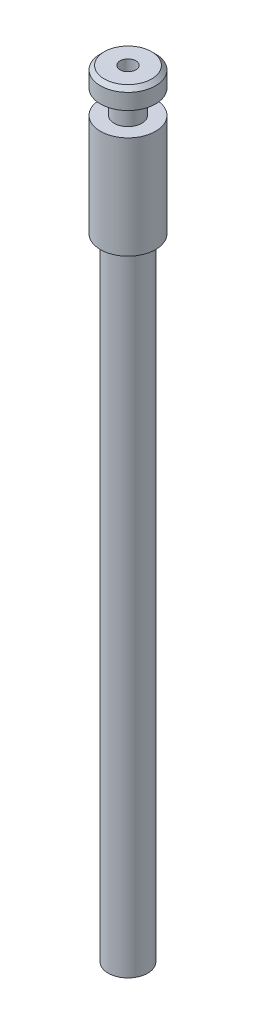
ISO-10303-21;
HEADER;
FILE_DESCRIPTION(('STEP AP214'),'2;1');
FILE_NAME('part.step','',(''),(''),'','','');
FILE_SCHEMA(('AUTOMOTIVE_DESIGN { 1 0 10303 214 1 1 1 1 }'));
ENDSEC;
DATA;
#1=APPLICATION_CONTEXT('core data for automotive mechanical design processes');
#2=APPLICATION_PROTOCOL_DEFINITION('international standard','automotive_design',2000,#1);
#3=PRODUCT_CONTEXT('',#1,'mechanical');
#4=PRODUCT('Part','Part','',(#3));
#5=PRODUCT_RELATED_PRODUCT_CATEGORY('part','',(#4));
#6=PRODUCT_DEFINITION_FORMATION('','',#4);
#7=PRODUCT_DEFINITION_CONTEXT('part definition',#1,'design');
#8=PRODUCT_DEFINITION('design','',#6,#7);
#9=PRODUCT_DEFINITION_SHAPE('','',#8);
#10=(LENGTH_UNIT() NAMED_UNIT(*) SI_UNIT(.MILLI.,.METRE.));
#11=(NAMED_UNIT(*) PLANE_ANGLE_UNIT() SI_UNIT($,.RADIAN.));
#12=(NAMED_UNIT(*) SI_UNIT($,.STERADIAN.) SOLID_ANGLE_UNIT());
#13=UNCERTAINTY_MEASURE_WITH_UNIT(LENGTH_MEASURE(1.E-05),#10,'distance_accuracy_value','');
#14=(GEOMETRIC_REPRESENTATION_CONTEXT(3) GLOBAL_UNCERTAINTY_ASSIGNED_CONTEXT((#13)) GLOBAL_UNIT_ASSIGNED_CONTEXT((#10,
#11,#12)) REPRESENTATION_CONTEXT('',''));
#15=CARTESIAN_POINT('',(0.,0.,0.));
#16=DIRECTION('',(0.,0.,1.));
#17=DIRECTION('',(1.,0.,0.));
#18=AXIS2_PLACEMENT_3D('',#15,#16,#17);
#19=CARTESIAN_POINT('',(0.,-16.,0.));
#20=DIRECTION('',(0.,-1.,0.));
#21=DIRECTION('',(0.,0.,-1.));
#22=AXIS2_PLACEMENT_3D('',#19,#20,#21);
#23=PLANE('',#22);
#24=CARTESIAN_POINT('',(0.,-16.,0.));
#25=DIRECTION('',(0.,-1.,0.));
#26=DIRECTION('',(0.,0.,-1.));
#27=AXIS2_PLACEMENT_3D('',#24,#25,#26);
#28=CIRCLE('',#27,3.5);
#29=CARTESIAN_POINT('',(0.,-16.,3.5));
#30=VERTEX_POINT('',#29);
#31=EDGE_CURVE('E53',#30,#30,#28,.T.);
#32=ORIENTED_EDGE('',*,*,#31,.T.);
#33=EDGE_LOOP('',(#32));
#34=FACE_BOUND('',#33,.T.);
#35=CARTESIAN_POINT('',(0.,-16.,0.));
#36=DIRECTION('',(0.,-1.,0.));
#37=DIRECTION('',(0.,0.,-1.));
#38=AXIS2_PLACEMENT_3D('',#35,#36,#37);
#39=CIRCLE('',#38,2.5);
#40=CARTESIAN_POINT('',(0.,-16.,-2.5));
#41=VERTEX_POINT('',#40);
#42=EDGE_CURVE('E60',#41,#41,#39,.T.);
#43=ORIENTED_EDGE('',*,*,#42,.F.);
#44=EDGE_LOOP('',(#43));
#45=FACE_BOUND('',#44,.T.);
#46=ADVANCED_FACE('F30',(#34,#45),#23,.T.);
#47=CARTESIAN_POINT('',(0.,0.,0.));
#48=DIRECTION('',(0.,1.,0.));
#49=DIRECTION('',(0.,0.,1.));
#50=AXIS2_PLACEMENT_3D('',#47,#48,#49);
#51=PLANE('',#50);
#52=CARTESIAN_POINT('',(0.,0.,0.));
#53=DIRECTION('',(0.,1.,0.));
#54=DIRECTION('',(0.,0.,1.));
#55=AXIS2_PLACEMENT_3D('',#52,#53,#54);
#56=CIRCLE('',#55,3.5);
#57=CARTESIAN_POINT('',(0.,0.,3.5));
#58=VERTEX_POINT('',#57);
#59=EDGE_CURVE('E45',#58,#58,#56,.T.);
#60=ORIENTED_EDGE('',*,*,#59,.F.);
#61=EDGE_LOOP('',(#60));
#62=FACE_BOUND('',#61,.T.);
#63=CARTESIAN_POINT('',(0.,0.,0.));
#64=DIRECTION('',(0.,1.,0.));
#65=DIRECTION('',(0.,0.,1.));
#66=AXIS2_PLACEMENT_3D('',#63,#64,#65);
#67=CIRCLE('',#66,1.75);
#68=CARTESIAN_POINT('',(0.,0.,1.75));
#69=VERTEX_POINT('',#68);
#70=EDGE_CURVE('E10',#69,#69,#67,.F.);
#71=ORIENTED_EDGE('',*,*,#70,.F.);
#72=EDGE_LOOP('',(#71));
#73=FACE_BOUND('',#72,.T.);
#74=ADVANCED_FACE('F98',(#62,#73),#51,.F.);
#75=CARTESIAN_POINT('',(0.,2.5,0.));
#76=DIRECTION('',(0.,-1.,0.));
#77=DIRECTION('',(0.,0.,-1.));
#78=AXIS2_PLACEMENT_3D('',#75,#76,#77);
#79=CYLINDRICAL_SURFACE('',#78,3.5);
#80=CARTESIAN_POINT('',(0.,2.,0.));
#81=DIRECTION('',(0.,1.,0.));
#82=DIRECTION('',(0.,0.,1.));
#83=AXIS2_PLACEMENT_3D('',#80,#81,#82);
#84=CIRCLE('',#83,3.5);
#85=CARTESIAN_POINT('',(0.,2.,3.5));
#86=VERTEX_POINT('',#85);
#87=EDGE_CURVE('E37',#86,#86,#84,.F.);
#88=ORIENTED_EDGE('',*,*,#87,.T.);
#89=EDGE_LOOP('',(#88));
#90=FACE_BOUND('',#89,.T.);
#91=ORIENTED_EDGE('',*,*,#59,.T.);
#92=EDGE_LOOP('',(#91));
#93=FACE_BOUND('',#92,.T.);
#94=ADVANCED_FACE('F84',(#90,#93),#79,.T.);
#95=CARTESIAN_POINT('',(0.,2.5,0.));
#96=DIRECTION('',(0.,1.,0.));
#97=DIRECTION('',(0.,0.,1.));
#98=AXIS2_PLACEMENT_3D('',#95,#96,#97);
#99=PLANE('',#98);
#100=CARTESIAN_POINT('',(0.,2.5,0.));
#101=DIRECTION('',(0.,1.,0.));
#102=DIRECTION('',(0.,0.,1.));
#103=AXIS2_PLACEMENT_3D('',#100,#101,#102);
#104=CIRCLE('',#103,1.);
#105=CARTESIAN_POINT('',(0.,2.5,1.));
#106=VERTEX_POINT('',#105);
#107=EDGE_CURVE('E66',#106,#106,#104,.T.);
#108=ORIENTED_EDGE('',*,*,#107,.F.);
#109=EDGE_LOOP('',(#108));
#110=FACE_BOUND('',#109,.T.);
#111=CARTESIAN_POINT('',(0.,2.5,0.));
#112=DIRECTION('',(0.,1.,0.));
#113=DIRECTION('',(0.,0.,1.));
#114=AXIS2_PLACEMENT_3D('',#111,#112,#113);
#115=CIRCLE('',#114,3.);
#116=CARTESIAN_POINT('',(0.,2.5,3.));
#117=VERTEX_POINT('',#116);
#118=EDGE_CURVE('E41',#117,#117,#115,.T.);
#119=ORIENTED_EDGE('',*,*,#118,.T.);
#120=EDGE_LOOP('',(#119));
#121=FACE_BOUND('',#120,.T.);
#122=ADVANCED_FACE('F81',(#110,#121),#99,.T.);
#123=CARTESIAN_POINT('',(0.,2.5,0.));
#124=DIRECTION('',(0.,-1.,0.));
#125=DIRECTION('',(0.,0.,-1.));
#126=AXIS2_PLACEMENT_3D('',#123,#124,#125);
#127=CONICAL_SURFACE('',#126,3.,0.785398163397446);
#128=ORIENTED_EDGE('',*,*,#87,.F.);
#129=EDGE_LOOP('',(#128));
#130=FACE_BOUND('',#129,.T.);
#131=ORIENTED_EDGE('',*,*,#118,.F.);
#132=EDGE_LOOP('',(#131));
#133=FACE_BOUND('',#132,.T.);
#134=ADVANCED_FACE('F32',(#130,#133),#127,.T.);
#135=CARTESIAN_POINT('',(0.,-3.,0.));
#136=DIRECTION('',(0.,1.,0.));
#137=DIRECTION('',(0.,0.,1.));
#138=AXIS2_PLACEMENT_3D('',#135,#136,#137);
#139=CYLINDRICAL_SURFACE('',#138,1.75);
#140=CARTESIAN_POINT('',(0.,-3.,0.));
#141=DIRECTION('',(0.,-1.,0.));
#142=DIRECTION('',(0.,0.,-1.));
#143=AXIS2_PLACEMENT_3D('',#140,#141,#142);
#144=CIRCLE('',#143,1.75);
#145=CARTESIAN_POINT('',(0.,-3.,-1.75));
#146=VERTEX_POINT('',#145);
#147=EDGE_CURVE('E50',#146,#146,#144,.T.);
#148=ORIENTED_EDGE('',*,*,#147,.F.);
#149=EDGE_LOOP('',(#148));
#150=FACE_BOUND('',#149,.T.);
#151=ORIENTED_EDGE('',*,*,#70,.T.);
#152=EDGE_LOOP('',(#151));
#153=FACE_BOUND('',#152,.T.);
#154=ADVANCED_FACE('F89',(#150,#153),#139,.T.);
#155=CARTESIAN_POINT('',(0.,-3.,0.));
#156=DIRECTION('',(0.,-1.,0.));
#157=DIRECTION('',(0.,0.,-1.));
#158=AXIS2_PLACEMENT_3D('',#155,#156,#157);
#159=PLANE('',#158);
#160=CARTESIAN_POINT('',(0.,-3.,0.));
#161=DIRECTION('',(0.,-1.,0.));
#162=DIRECTION('',(0.,0.,-1.));
#163=AXIS2_PLACEMENT_3D('',#160,#161,#162);
#164=CIRCLE('',#163,3.5);
#165=CARTESIAN_POINT('',(0.,-3.,3.5));
#166=VERTEX_POINT('',#165);
#167=EDGE_CURVE('E54',#166,#166,#164,.T.);
#168=ORIENTED_EDGE('',*,*,#167,.F.);
#169=EDGE_LOOP('',(#168));
#170=FACE_BOUND('',#169,.T.);
#171=ORIENTED_EDGE('',*,*,#147,.T.);
#172=EDGE_LOOP('',(#171));
#173=FACE_BOUND('',#172,.T.);
#174=ADVANCED_FACE('F94',(#170,#173),#159,.F.);
#175=CARTESIAN_POINT('',(0.,-16.,0.));
#176=DIRECTION('',(0.,1.,0.));
#177=DIRECTION('',(0.,0.,1.));
#178=AXIS2_PLACEMENT_3D('',#175,#176,#177);
#179=CYLINDRICAL_SURFACE('',#178,3.5);
#180=CARTESIAN_POINT('',(0.,-16.,3.5));
#181=CARTESIAN_POINT('',(0.,-15.8645833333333,3.5));
#182=CARTESIAN_POINT('',(0.,-15.7291666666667,3.5));
#183=CARTESIAN_POINT('',(0.,-15.4583333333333,3.5));
#184=CARTESIAN_POINT('',(0.,-15.3229166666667,3.5));
#185=CARTESIAN_POINT('',(0.,-15.0520833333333,3.5));
#186=CARTESIAN_POINT('',(0.,-14.9166666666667,3.5));
#187=CARTESIAN_POINT('',(0.,-14.6458333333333,3.5));
#188=CARTESIAN_POINT('',(0.,-14.5104166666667,3.5));
#189=CARTESIAN_POINT('',(0.,-14.2395833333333,3.5));
#190=CARTESIAN_POINT('',(0.,-14.1041666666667,3.5));
#191=CARTESIAN_POINT('',(0.,-13.8333333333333,3.5));
#192=CARTESIAN_POINT('',(0.,-13.6979166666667,3.5));
#193=CARTESIAN_POINT('',(0.,-13.4270833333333,3.5));
#194=CARTESIAN_POINT('',(0.,-13.2916666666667,3.5));
#195=CARTESIAN_POINT('',(0.,-13.0208333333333,3.5));
#196=CARTESIAN_POINT('',(0.,-12.8854166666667,3.5));
#197=CARTESIAN_POINT('',(0.,-12.6145833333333,3.5));
#198=CARTESIAN_POINT('',(0.,-12.4791666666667,3.5));
#199=CARTESIAN_POINT('',(0.,-12.2083333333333,3.5));
#200=CARTESIAN_POINT('',(0.,-12.0729166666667,3.5));
#201=CARTESIAN_POINT('',(0.,-11.8020833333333,3.5));
#202=CARTESIAN_POINT('',(0.,-11.6666666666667,3.5));
#203=CARTESIAN_POINT('',(0.,-11.3958333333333,3.5));
#204=CARTESIAN_POINT('',(0.,-11.2604166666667,3.5));
#205=CARTESIAN_POINT('',(0.,-10.9895833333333,3.5));
#206=CARTESIAN_POINT('',(0.,-10.8541666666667,3.5));
#207=CARTESIAN_POINT('',(0.,-10.5833333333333,3.5));
#208=CARTESIAN_POINT('',(0.,-10.4479166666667,3.5));
#209=CARTESIAN_POINT('',(0.,-10.1770833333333,3.5));
#210=CARTESIAN_POINT('',(0.,-10.0416666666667,3.5));
#211=CARTESIAN_POINT('',(0.,-9.77083333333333,3.5));
#212=CARTESIAN_POINT('',(0.,-9.63541666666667,3.5));
#213=CARTESIAN_POINT('',(0.,-9.36458333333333,3.5));
#214=CARTESIAN_POINT('',(0.,-9.22916666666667,3.5));
#215=CARTESIAN_POINT('',(0.,-8.95833333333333,3.5));
#216=CARTESIAN_POINT('',(0.,-8.82291666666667,3.5));
#217=CARTESIAN_POINT('',(0.,-8.55208333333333,3.5));
#218=CARTESIAN_POINT('',(0.,-8.41666666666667,3.5));
#219=CARTESIAN_POINT('',(0.,-8.14583333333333,3.5));
#220=CARTESIAN_POINT('',(0.,-8.01041666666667,3.5));
#221=CARTESIAN_POINT('',(0.,-7.73958333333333,3.5));
#222=CARTESIAN_POINT('',(0.,-7.60416666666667,3.5));
#223=CARTESIAN_POINT('',(0.,-7.33333333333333,3.5));
#224=CARTESIAN_POINT('',(0.,-7.19791666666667,3.5));
#225=CARTESIAN_POINT('',(0.,-6.92708333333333,3.5));
#226=CARTESIAN_POINT('',(0.,-6.79166666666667,3.5));
#227=CARTESIAN_POINT('',(0.,-6.52083333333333,3.5));
#228=CARTESIAN_POINT('',(0.,-6.38541666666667,3.5));
#229=CARTESIAN_POINT('',(0.,-6.11458333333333,3.5));
#230=CARTESIAN_POINT('',(0.,-5.97916666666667,3.5));
#231=CARTESIAN_POINT('',(0.,-5.70833333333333,3.5));
#232=CARTESIAN_POINT('',(0.,-5.57291666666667,3.5));
#233=CARTESIAN_POINT('',(0.,-5.30208333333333,3.5));
#234=CARTESIAN_POINT('',(0.,-5.16666666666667,3.5));
#235=CARTESIAN_POINT('',(0.,-4.89583333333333,3.5));
#236=CARTESIAN_POINT('',(0.,-4.76041666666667,3.5));
#237=CARTESIAN_POINT('',(0.,-4.48958333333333,3.5));
#238=CARTESIAN_POINT('',(0.,-4.35416666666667,3.5));
#239=CARTESIAN_POINT('',(0.,-4.08333333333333,3.5));
#240=CARTESIAN_POINT('',(0.,-3.94791666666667,3.5));
#241=CARTESIAN_POINT('',(0.,-3.67708333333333,3.5));
#242=CARTESIAN_POINT('',(0.,-3.54166666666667,3.5));
#243=CARTESIAN_POINT('',(0.,-3.27083333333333,3.5));
#244=CARTESIAN_POINT('',(0.,-3.13541666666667,3.5));
#245=CARTESIAN_POINT('',(0.,-3.,3.5));
#246=B_SPLINE_CURVE_WITH_KNOTS('',3,(#180,#181,#182,#183,#184,#185,#186,#187,#188,#189,#190,
#191,#192,#193,#194,#195,#196,#197,#198,#199,#200,#201,#202,#203,#204,#205,#206,#207,#208,#209,
#210,#211,#212,#213,#214,#215,#216,#217,#218,#219,#220,#221,#222,#223,#224,#225,#226,#227,#228,
#229,#230,#231,#232,#233,#234,#235,#236,#237,#238,#239,#240,#241,#242,#243,#244,#245),
.UNSPECIFIED.,.F.,.F.,(4,2,2,2,2,2,2,2,2,2,2,2,2,2,2,2,2,2,2,2,2,2,2,2,2,2,2,2,2,2,2,2,4),(0.,
0.406250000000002,0.812500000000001,1.21875,1.625,2.03125,2.4375,2.84375,3.25,3.65625,4.0625,
4.46875,4.875,5.28125,5.6875,6.09375,6.5,6.90625,7.3125,7.71875,8.125,8.53125,8.9375,9.34375,
9.75,10.15625,10.5625,10.96875,11.375,11.78125,12.1875,12.59375,13.),.UNSPECIFIED.);
#247=EDGE_CURVE('BSEAM113',#30,#166,#246,.T.);
#248=ORIENTED_EDGE('',*,*,#31,.F.);
#249=ORIENTED_EDGE('',*,*,#167,.T.);
#250=ORIENTED_EDGE('',*,*,#247,.T.);
#251=ORIENTED_EDGE('',*,*,#247,.F.);
#252=EDGE_LOOP('',(#248,#250,#249,#251));
#253=FACE_BOUND('',#252,.T.);
#254=ADVANCED_FACE('F113',(#253),#179,.T.);
#255=CARTESIAN_POINT('',(0.,-96.,0.));
#256=DIRECTION('',(0.,1.,0.));
#257=DIRECTION('',(0.,0.,1.));
#258=AXIS2_PLACEMENT_3D('',#255,#256,#257);
#259=CYLINDRICAL_SURFACE('',#258,2.5);
#260=CARTESIAN_POINT('',(0.,-96.,0.));
#261=DIRECTION('',(0.,-1.,0.));
#262=DIRECTION('',(0.,0.,-1.));
#263=AXIS2_PLACEMENT_3D('',#260,#261,#262);
#264=CIRCLE('',#263,2.5);
#265=CARTESIAN_POINT('',(0.,-96.,-2.5));
#266=VERTEX_POINT('',#265);
#267=EDGE_CURVE('E57',#266,#266,#264,.T.);
#268=ORIENTED_EDGE('',*,*,#267,.F.);
#269=EDGE_LOOP('',(#268));
#270=FACE_BOUND('',#269,.T.);
#271=ORIENTED_EDGE('',*,*,#42,.T.);
#272=EDGE_LOOP('',(#271));
#273=FACE_BOUND('',#272,.T.);
#274=ADVANCED_FACE('F109',(#270,#273),#259,.T.);
#275=CARTESIAN_POINT('',(0.,-96.,0.));
#276=DIRECTION('',(0.,-1.,0.));
#277=DIRECTION('',(0.,0.,-1.));
#278=AXIS2_PLACEMENT_3D('',#275,#276,#277);
#279=PLANE('',#278);
#280=CARTESIAN_POINT('',(0.,-96.,0.));
#281=DIRECTION('',(0.,1.,0.));
#282=DIRECTION('',(0.,0.,1.));
#283=AXIS2_PLACEMENT_3D('',#280,#281,#282);
#284=CIRCLE('',#283,1.);
#285=CARTESIAN_POINT('',(0.,-96.,1.));
#286=VERTEX_POINT('',#285);
#287=EDGE_CURVE('E63',#286,#286,#284,.T.);
#288=ORIENTED_EDGE('',*,*,#287,.T.);
#289=EDGE_LOOP('',(#288));
#290=FACE_BOUND('',#289,.T.);
#291=ORIENTED_EDGE('',*,*,#267,.T.);
#292=EDGE_LOOP('',(#291));
#293=FACE_BOUND('',#292,.T.);
#294=ADVANCED_FACE('F72',(#290,#293),#279,.T.);
#295=CARTESIAN_POINT('',(0.,-96.,0.));
#296=DIRECTION('',(0.,1.,0.));
#297=DIRECTION('',(0.,0.,1.));
#298=AXIS2_PLACEMENT_3D('',#295,#296,#297);
#299=CYLINDRICAL_SURFACE('',#298,1.);
#300=ORIENTED_EDGE('',*,*,#287,.F.);
#301=EDGE_LOOP('',(#300));
#302=FACE_BOUND('',#301,.T.);
#303=ORIENTED_EDGE('',*,*,#107,.T.);
#304=EDGE_LOOP('',(#303));
#305=FACE_BOUND('',#304,.T.);
#306=ADVANCED_FACE('F75',(#302,#305),#299,.F.);
#307=CLOSED_SHELL('',(#46,#74,#94,#122,#134,#154,#174,#254,#274,#294,#306));
#308=MANIFOLD_SOLID_BREP('B2',#307);
#309=ADVANCED_BREP_SHAPE_REPRESENTATION('',(#18,#308),#14);
#310=SHAPE_DEFINITION_REPRESENTATION(#9,#309);
ENDSEC;
END-ISO-10303-21;
